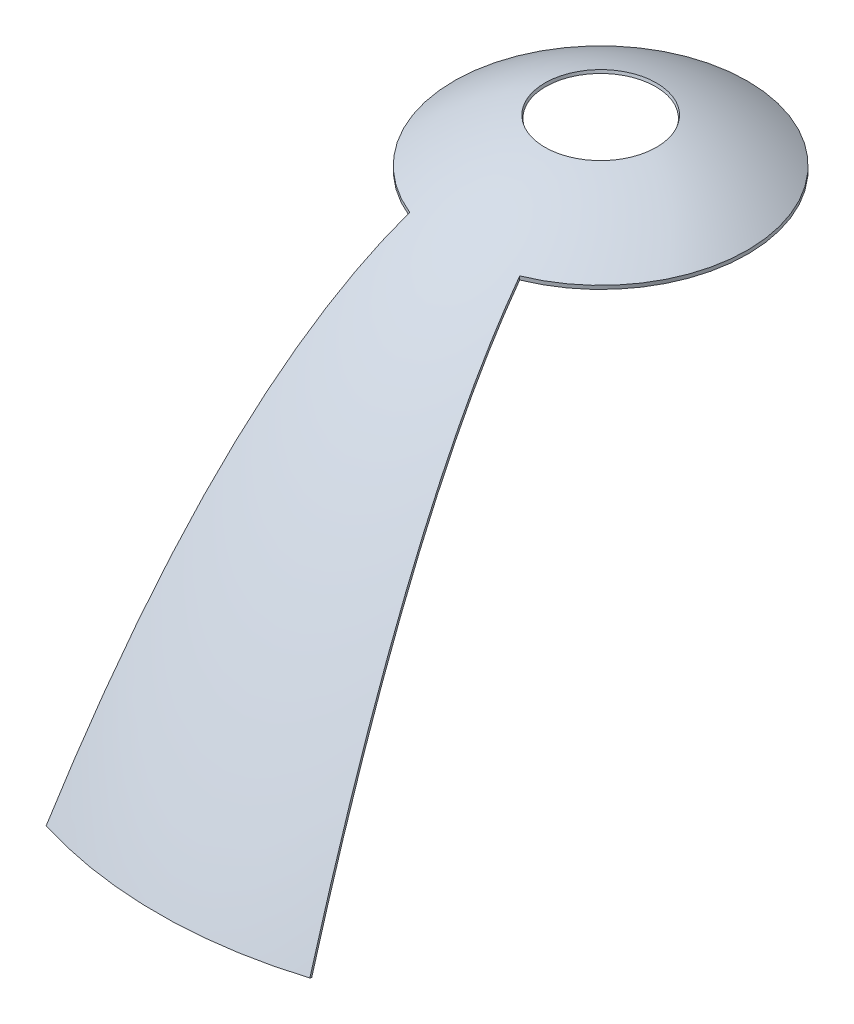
ISO-10303-21;
HEADER;
FILE_DESCRIPTION(('STEP AP214'),'2;1');
FILE_NAME('part.step','',(''),(''),'','','');
FILE_SCHEMA(('AUTOMOTIVE_DESIGN { 1 0 10303 214 1 1 1 1 }'));
ENDSEC;
DATA;
#1=APPLICATION_CONTEXT('core data for automotive mechanical design processes');
#2=APPLICATION_PROTOCOL_DEFINITION('international standard','automotive_design',2000,#1);
#3=PRODUCT_CONTEXT('',#1,'mechanical');
#4=PRODUCT('Part','Part','',(#3));
#5=PRODUCT_RELATED_PRODUCT_CATEGORY('part','',(#4));
#6=PRODUCT_DEFINITION_FORMATION('','',#4);
#7=PRODUCT_DEFINITION_CONTEXT('part definition',#1,'design');
#8=PRODUCT_DEFINITION('design','',#6,#7);
#9=PRODUCT_DEFINITION_SHAPE('','',#8);
#10=(LENGTH_UNIT() NAMED_UNIT(*) SI_UNIT(.MILLI.,.METRE.));
#11=(NAMED_UNIT(*) PLANE_ANGLE_UNIT() SI_UNIT($,.RADIAN.));
#12=(NAMED_UNIT(*) SI_UNIT($,.STERADIAN.) SOLID_ANGLE_UNIT());
#13=UNCERTAINTY_MEASURE_WITH_UNIT(LENGTH_MEASURE(1.E-05),#10,'distance_accuracy_value','');
#14=(GEOMETRIC_REPRESENTATION_CONTEXT(3) GLOBAL_UNCERTAINTY_ASSIGNED_CONTEXT((#13)) GLOBAL_UNIT_ASSIGNED_CONTEXT((#10,
#11,#12)) REPRESENTATION_CONTEXT('',''));
#15=CARTESIAN_POINT('',(0.,0.,0.));
#16=DIRECTION('',(0.,0.,1.));
#17=DIRECTION('',(1.,0.,0.));
#18=AXIS2_PLACEMENT_3D('',#15,#16,#17);
#19=CARTESIAN_POINT('',(-7.60368371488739,64.2465592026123,0.));
#20=CARTESIAN_POINT('',(-8.75613907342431,63.9372608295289,0.));
#21=CARTESIAN_POINT('',(-11.0024123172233,63.2031834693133,0.));
#22=CARTESIAN_POINT('',(-15.5311840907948,61.2016276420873,0.));
#23=CARTESIAN_POINT('',(-21.1339600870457,57.7361302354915,0.));
#24=CARTESIAN_POINT('',(-27.8053729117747,52.0322327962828,0.));
#25=CARTESIAN_POINT('',(-34.4185115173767,44.7890583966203,0.));
#26=CARTESIAN_POINT('',(-40.9799131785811,36.0065554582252,0.));
#27=CARTESIAN_POINT('',(-46.4060814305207,27.4053913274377,0.));
#28=CARTESIAN_POINT('',(-50.7234198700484,19.7538499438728,0.));
#29=CARTESIAN_POINT('',(-53.9487924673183,13.6319795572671,0.));
#30=CARTESIAN_POINT('',(-56.6295110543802,8.20367023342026,0.));
#31=CARTESIAN_POINT('',(-58.762424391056,3.6814756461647,0.));
#32=CARTESIAN_POINT('',(-59.8376879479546,1.33240552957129,0.));
#33=CARTESIAN_POINT('',(-60.3646091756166,0.164499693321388,0.));
#34=B_SPLINE_CURVE_WITH_KNOTS('',3,(#19,#20,#21,#22,#23,#24,#25,#26,#27,#28,#29,#30,#31,#32,
#33),.UNSPECIFIED.,.F.,.F.,(4,1,1,1,1,1,1,1,1,1,1,1,4),(0.496025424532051,0.496245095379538,
0.496464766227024,0.496904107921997,0.49734344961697,0.497782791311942,0.498222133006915,
0.498661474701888,0.498881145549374,0.499100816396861,0.499320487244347,0.49943032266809,
0.499540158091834),.UNSPECIFIED.);
#35=CARTESIAN_POINT('',(0.,0.,0.));
#36=DIRECTION('',(0.,-1.,0.));
#37=AXIS1_PLACEMENT('',#35,#36);
#38=SURFACE_OF_REVOLUTION('',#34,#37);
#39=CARTESIAN_POINT('',(0.,58.2847956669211,0.));
#40=DIRECTION('',(0.,-1.,0.));
#41=DIRECTION('',(0.,0.,-1.));
#42=AXIS2_PLACEMENT_3D('',#39,#40,#41);
#43=CIRCLE('',#42,20.0000000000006);
#44=CARTESIAN_POINT('',(7.5,58.2847956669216,18.5404962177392));
#45=VERTEX_POINT('',#44);
#46=CARTESIAN_POINT('',(-7.5,58.2847956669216,18.5404962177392));
#47=VERTEX_POINT('',#46);
#48=EDGE_CURVE('E79',#45,#47,#43,.F.);
#49=ORIENTED_EDGE('',*,*,#48,.T.);
#50=CARTESIAN_POINT('',(-7.49999999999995,58.2847956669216,18.540496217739));
#51=CARTESIAN_POINT('',(-7.63904423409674,57.9133384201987,19.0594163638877));
#52=CARTESIAN_POINT('',(-7.77623549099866,57.5316467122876,19.5714211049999));
#53=CARTESIAN_POINT('',(-8.04665504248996,56.7506706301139,20.5806406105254));
#54=CARTESIAN_POINT('',(-8.17989292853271,56.3514358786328,21.07789117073));
#55=CARTESIAN_POINT('',(-8.44267026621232,55.5369276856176,22.058589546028));
#56=CARTESIAN_POINT('',(-8.57221550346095,55.1216820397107,22.5420589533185));
#57=CARTESIAN_POINT('',(-8.82784207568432,54.2764890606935,23.4960703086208));
#58=CARTESIAN_POINT('',(-8.95392648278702,53.8465555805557,23.9666237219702));
#59=CARTESIAN_POINT('',(-9.20283586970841,52.9732084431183,24.8955662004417));
#60=CARTESIAN_POINT('',(-9.32566207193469,52.5297999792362,25.3539598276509));
#61=CARTESIAN_POINT('',(-9.56823531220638,51.6306090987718,26.2592554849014));
#62=CARTESIAN_POINT('',(-9.68798238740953,51.1748268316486,26.7061576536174));
#63=CARTESIAN_POINT('',(-9.9231557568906,50.2573886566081,27.5838366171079));
#64=CARTESIAN_POINT('',(-10.0386161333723,49.7958630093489,28.0147406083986));
#65=CARTESIAN_POINT('',(-10.2668369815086,48.8626132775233,28.8664724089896));
#66=CARTESIAN_POINT('',(-10.379596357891,48.390885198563,29.2872961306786));
#67=CARTESIAN_POINT('',(-10.6025389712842,47.438088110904,30.1193292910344));
#68=CARTESIAN_POINT('',(-10.7127211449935,46.9570153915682,30.5305347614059));
#69=CARTESIAN_POINT('',(-10.9306190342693,45.9863399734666,31.3437407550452));
#70=CARTESIAN_POINT('',(-11.038333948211,45.4967345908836,31.7457382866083));
#71=CARTESIAN_POINT('',(-11.2513956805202,44.5097641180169,32.5408954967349));
#72=CARTESIAN_POINT('',(-11.3567421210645,44.0123978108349,32.9340537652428));
#73=CARTESIAN_POINT('',(-11.5651515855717,43.0106416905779,33.7118484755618));
#74=CARTESIAN_POINT('',(-11.6682147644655,42.5062523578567,34.0964854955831));
#75=CARTESIAN_POINT('',(-11.9805351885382,40.9515652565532,35.2620811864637));
#76=CARTESIAN_POINT('',(-12.1862700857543,39.8906707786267,36.0298942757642));
#77=CARTESIAN_POINT('',(-12.5893169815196,37.7456834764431,37.5340857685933));
#78=CARTESIAN_POINT('',(-12.786630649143,36.6615953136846,38.2704704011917));
#79=CARTESIAN_POINT('',(-13.173686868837,34.4730379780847,39.7149838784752));
#80=CARTESIAN_POINT('',(-13.3634274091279,33.3685635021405,40.4231052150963));
#81=CARTESIAN_POINT('',(-13.7360319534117,31.1417305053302,41.8136843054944));
#82=CARTESIAN_POINT('',(-13.9188926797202,30.0193638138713,42.4961298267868));
#83=CARTESIAN_POINT('',(-14.2783201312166,27.758947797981,43.8375313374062));
#84=CARTESIAN_POINT('',(-14.4548837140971,26.6208910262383,44.496475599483));
#85=CARTESIAN_POINT('',(-14.8022085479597,24.3310770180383,45.7927095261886));
#86=CARTESIAN_POINT('',(-14.9729675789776,23.1793147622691,46.4299909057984));
#87=CARTESIAN_POINT('',(-15.3133685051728,20.8345346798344,47.7003844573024));
#88=CARTESIAN_POINT('',(-15.4828706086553,19.6412142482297,48.3329749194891));
#89=CARTESIAN_POINT('',(-15.8166017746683,17.2438405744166,49.5784765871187));
#90=CARTESIAN_POINT('',(-15.9808315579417,16.0397888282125,50.1913904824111));
#91=CARTESIAN_POINT('',(-16.3043275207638,13.6227009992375,51.3986938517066));
#92=CARTESIAN_POINT('',(-16.4635966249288,12.4096707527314,51.9930942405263));
#93=CARTESIAN_POINT('',(-16.7774639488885,9.97633727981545,53.1644630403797));
#94=CARTESIAN_POINT('',(-16.9320672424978,8.7560438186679,53.7414503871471));
#95=CARTESIAN_POINT('',(-17.160712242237,6.92084476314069,54.5947651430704));
#96=CARTESIAN_POINT('',(-17.2363206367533,6.30884410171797,54.8769395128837));
#97=CARTESIAN_POINT('',(-17.3865223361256,5.08298410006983,55.4374998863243));
#98=CARTESIAN_POINT('',(-17.4611156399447,4.46912475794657,55.7158858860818));
#99=CARTESIAN_POINT('',(-17.6091539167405,3.2410868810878,56.2683722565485));
#100=CARTESIAN_POINT('',(-17.6826011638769,2.62691243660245,56.5424811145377));
#101=CARTESIAN_POINT('',(-17.8285647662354,1.39691714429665,57.0872246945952));
#102=CARTESIAN_POINT('',(-17.901081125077,0.781096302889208,57.357859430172));
#103=CARTESIAN_POINT('',(-17.9731522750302,0.164499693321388,57.6268326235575));
#104=B_SPLINE_CURVE_WITH_KNOTS('',3,(#50,#51,#52,#53,#54,#55,#56,#57,#58,#59,#60,#61,#62,#63,
#64,#65,#66,#67,#68,#69,#70,#71,#72,#73,#74,#75,#76,#77,#78,#79,#80,#81,#82,#83,#84,#85,#86,#87,
#88,#89,#90,#91,#92,#93,#94,#95,#96,#97,#98,#99,#100,#101,#102,#103),.UNSPECIFIED.,.F.,.F.,(4,2,
2,2,2,2,2,2,2,2,2,2,2,2,2,2,2,2,2,2,2,2,2,2,2,2,4),(0.,1.95920133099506,3.91317864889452,
5.86390434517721,7.81283840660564,9.76103062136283,11.7091993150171,13.6346750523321,
15.560918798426,17.4879437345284,19.4155861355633,21.3435338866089,23.2713504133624,
27.2475553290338,31.2229684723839,35.1994307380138,39.1777640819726,43.1580556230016,
47.1398526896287,51.2232944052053,55.3061755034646,59.3866020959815,63.4624186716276,
65.4968496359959,67.5312826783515,69.5609665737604,71.590642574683),.UNSPECIFIED.);
#105=CARTESIAN_POINT('',(-17.9731522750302,0.164499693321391,57.6268326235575));
#106=VERTEX_POINT('',#105);
#107=EDGE_CURVE('E89',#47,#106,#104,.T.);
#108=ORIENTED_EDGE('',*,*,#107,.T.);
#109=CARTESIAN_POINT('',(0.,0.164499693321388,0.));
#110=DIRECTION('',(0.,-1.,0.));
#111=DIRECTION('',(0.,0.,-1.));
#112=AXIS2_PLACEMENT_3D('',#109,#110,#111);
#113=CIRCLE('',#112,60.3646091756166);
#114=CARTESIAN_POINT('',(17.9731522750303,0.16449969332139,57.6268326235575));
#115=VERTEX_POINT('',#114);
#116=EDGE_CURVE('E98',#115,#106,#113,.T.);
#117=ORIENTED_EDGE('',*,*,#116,.F.);
#118=CARTESIAN_POINT('',(17.9731522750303,0.164499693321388,57.6268326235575));
#119=CARTESIAN_POINT('',(17.9222354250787,0.600151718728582,57.4368083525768));
#120=CARTESIAN_POINT('',(17.8710927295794,1.03540914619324,57.2459412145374));
#121=CARTESIAN_POINT('',(17.7683462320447,1.90511163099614,56.8624860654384));
#122=CARTESIAN_POINT('',(17.7167424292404,2.33955668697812,56.6698980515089));
#123=CARTESIAN_POINT('',(17.5611652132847,3.64214105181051,56.0892759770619));
#124=CARTESIAN_POINT('',(17.4564851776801,4.50902291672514,55.6986047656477));
#125=CARTESIAN_POINT('',(17.245068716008,6.23948860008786,54.9095877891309));
#126=CARTESIAN_POINT('',(17.1383314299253,7.10307085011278,54.5112388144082));
#127=CARTESIAN_POINT('',(16.9227406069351,8.82658811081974,53.7066429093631));
#128=CARTESIAN_POINT('',(16.8138864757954,9.68652201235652,53.3003937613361));
#129=CARTESIAN_POINT('',(16.5939637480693,11.4023213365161,52.4796309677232));
#130=CARTESIAN_POINT('',(16.4828948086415,12.2581861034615,52.0651160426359));
#131=CARTESIAN_POINT('',(16.2584303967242,13.9653995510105,51.2274034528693));
#132=CARTESIAN_POINT('',(16.1450348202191,14.8167480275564,50.8042053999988));
#133=CARTESIAN_POINT('',(15.912785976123,16.5367732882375,49.9374409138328));
#134=CARTESIAN_POINT('',(15.7938675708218,17.405318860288,49.4936313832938));
#135=CARTESIAN_POINT('',(15.5533156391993,19.1366727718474,48.5958793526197));
#136=CARTESIAN_POINT('',(15.4316823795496,19.9994816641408,48.1419378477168));
#137=CARTESIAN_POINT('',(15.1855465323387,21.7188213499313,47.223346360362));
#138=CARTESIAN_POINT('',(15.0610443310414,22.5753529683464,46.7586978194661));
#139=CARTESIAN_POINT('',(14.8089943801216,24.2815485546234,45.8180345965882));
#140=CARTESIAN_POINT('',(14.6814470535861,25.1312134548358,45.3420214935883));
#141=CARTESIAN_POINT('',(14.423109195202,26.823039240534,44.3778914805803));
#142=CARTESIAN_POINT('',(14.2923189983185,27.6652008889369,43.889775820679));
#143=CARTESIAN_POINT('',(14.0272736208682,29.3413295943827,42.9006130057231));
#144=CARTESIAN_POINT('',(13.8930185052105,30.1752968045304,42.3995660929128));
#145=CARTESIAN_POINT('',(13.6135584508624,31.8783665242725,41.3566069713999));
#146=CARTESIAN_POINT('',(13.4681511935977,32.7469740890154,40.8139396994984));
#147=CARTESIAN_POINT('',(13.1729278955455,34.4730129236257,39.7121513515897));
#148=CARTESIAN_POINT('',(13.0231116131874,35.3304435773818,39.1530293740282));
#149=CARTESIAN_POINT('',(12.7187320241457,37.0328037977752,38.0170692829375));
#150=CARTESIAN_POINT('',(12.5641681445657,37.8777318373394,37.4402290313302));
#151=CARTESIAN_POINT('',(12.2499014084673,39.5536153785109,36.2673696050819));
#152=CARTESIAN_POINT('',(12.0901969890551,40.3845665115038,35.6713445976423));
#153=CARTESIAN_POINT('',(11.7651916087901,42.0308486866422,34.4584080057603));
#154=CARTESIAN_POINT('',(11.5998870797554,42.8461692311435,33.8414831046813));
#155=CARTESIAN_POINT('',(11.2651727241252,44.4496057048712,32.5923121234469));
#156=CARTESIAN_POINT('',(11.0958269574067,45.2379208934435,31.9603051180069));
#157=CARTESIAN_POINT('',(10.7508513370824,46.793945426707,30.6728385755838));
#158=CARTESIAN_POINT('',(10.5752207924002,47.561652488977,30.0173764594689));
#159=CARTESIAN_POINT('',(10.2172963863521,49.072790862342,28.6815843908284));
#160=CARTESIAN_POINT('',(10.0350063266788,49.8162355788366,28.0012686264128));
#161=CARTESIAN_POINT('',(9.66331254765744,51.2748803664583,26.6140885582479));
#162=CARTESIAN_POINT('',(9.47391508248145,51.9901041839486,25.9072475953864));
#163=CARTESIAN_POINT('',(9.08744467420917,53.3880870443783,24.4649203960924));
#164=CARTESIAN_POINT('',(8.89037690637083,54.0708673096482,23.7294534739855));
#165=CARTESIAN_POINT('',(8.62577906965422,54.9441805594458,22.7419609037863));
#166=CARTESIAN_POINT('',(8.56195869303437,55.1516077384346,22.5037800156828));
#167=CARTESIAN_POINT('',(8.43348128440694,55.56255302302,22.0242957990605));
#168=CARTESIAN_POINT('',(8.36882427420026,55.7660712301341,21.7829925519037));
#169=CARTESIAN_POINT('',(8.23866137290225,56.1689956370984,21.2972179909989));
#170=CARTESIAN_POINT('',(8.1731555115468,56.3684019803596,21.0527467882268));
#171=CARTESIAN_POINT('',(8.0410769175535,56.7635052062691,20.5598227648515));
#172=CARTESIAN_POINT('',(7.97450153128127,56.9591888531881,20.3113600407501));
#173=CARTESIAN_POINT('',(7.8404655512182,57.3460029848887,19.8111309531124));
#174=CARTESIAN_POINT('',(7.77300491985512,57.5371332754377,19.5593644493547));
#175=CARTESIAN_POINT('',(7.63718058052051,57.9146157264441,19.0524611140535));
#176=CARTESIAN_POINT('',(7.56881675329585,58.1009672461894,18.7973238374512));
#177=CARTESIAN_POINT('',(7.49999999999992,58.2847956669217,18.5404962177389));
#178=B_SPLINE_CURVE_WITH_KNOTS('',3,(#118,#119,#120,#121,#122,#123,#124,#125,#126,#127,#128,
#129,#130,#131,#132,#133,#134,#135,#136,#137,#138,#139,#140,#141,#142,#143,#144,#145,#146,#147,
#148,#149,#150,#151,#152,#153,#154,#155,#156,#157,#158,#159,#160,#161,#162,#163,#164,#165,#166,
#167,#168,#169,#170,#171,#172,#173,#174,#175,#176,#177),.UNSPECIFIED.,.F.,.F.,(4,2,2,2,2,2,2,2,
2,2,2,2,2,2,2,2,2,2,2,2,2,2,2,2,2,2,2,2,2,4),(0.,1.43403067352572,2.86806373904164,
5.73779738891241,8.60875790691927,11.4805363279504,14.3527627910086,17.2251179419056,
20.1728144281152,23.12022263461,26.067236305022,29.0138428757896,31.9601463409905,
34.9063946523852,38.0095928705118,41.1129614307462,44.2167059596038,47.3214032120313,
50.4281173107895,53.5011004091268,56.5744224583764,59.6460166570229,62.7149686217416,
65.7818846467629,66.7485334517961,67.7151571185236,68.6817470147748,69.6512981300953,
70.6208905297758,71.5906122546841),.UNSPECIFIED.);
#179=EDGE_CURVE('E92',#115,#45,#178,.T.);
#180=ORIENTED_EDGE('',*,*,#179,.T.);
#181=EDGE_LOOP('',(#49,#108,#117,#180));
#182=FACE_BOUND('',#181,.T.);
#183=CARTESIAN_POINT('',(0.,64.2465592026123,0.));
#184=DIRECTION('',(0.,-1.,0.));
#185=DIRECTION('',(0.,0.,-1.));
#186=AXIS2_PLACEMENT_3D('',#183,#184,#185);
#187=CIRCLE('',#186,7.60368371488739);
#188=CARTESIAN_POINT('',(0.,64.2465592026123,-7.60368371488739));
#189=VERTEX_POINT('',#188);
#190=EDGE_CURVE('E88',#189,#189,#187,.T.);
#191=ORIENTED_EDGE('',*,*,#190,.T.);
#192=EDGE_LOOP('',(#191));
#193=FACE_BOUND('',#192,.T.);
#194=ADVANCED_FACE('F32',(#182,#193),#38,.T.);
#195=CARTESIAN_POINT('',(0.,0.164499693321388,0.));
#196=DIRECTION('',(0.,1.,0.));
#197=DIRECTION('',(0.,0.,1.));
#198=AXIS2_PLACEMENT_3D('',#195,#196,#197);
#199=CONICAL_SURFACE('',#198,60.3646091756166,1.14697219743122);
#200=ORIENTED_EDGE('',*,*,#116,.T.);
#201=CARTESIAN_POINT('',(-26.2214343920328,14.5349801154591,88.4098405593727));
#202=CARTESIAN_POINT('',(-25.4245611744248,13.1463818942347,85.435869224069));
#203=CARTESIAN_POINT('',(-24.6276838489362,11.7578188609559,82.4618825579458));
#204=CARTESIAN_POINT('',(-23.033916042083,8.98080587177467,76.5138601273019));
#205=CARTESIAN_POINT('',(-22.2370255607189,7.59235591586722,73.5398243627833));
#206=CARTESIAN_POINT('',(-20.6432265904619,4.81561193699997,67.5916856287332));
#207=CARTESIAN_POINT('',(-19.8463181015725,3.42731791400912,64.6175826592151));
#208=CARTESIAN_POINT('',(-18.2524738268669,0.650963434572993,58.6692748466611));
#209=CARTESIAN_POINT('',(-17.4555380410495,-0.737097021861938,55.6950700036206));
#210=CARTESIAN_POINT('',(-15.8616236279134,-3.51285366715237,49.7465004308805));
#211=CARTESIAN_POINT('',(-15.0646450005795,-4.90054985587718,46.7721357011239));
#212=CARTESIAN_POINT('',(-13.8691213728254,-6.98161610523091,42.3103807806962));
#213=CARTESIAN_POINT('',(-13.4706042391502,-7.6752251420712,40.8230945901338));
#214=CARTESIAN_POINT('',(-12.6735440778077,-9.06222121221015,37.8484255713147));
#215=CARTESIAN_POINT('',(-12.2750010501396,-9.75560824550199,36.361042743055));
#216=CARTESIAN_POINT('',(-11.4778782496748,-11.1420686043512,33.3861399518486));
#217=CARTESIAN_POINT('',(-11.0792984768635,-11.8351419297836,31.8986199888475));
#218=CARTESIAN_POINT('',(-10.2820844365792,-13.220820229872,28.9233766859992));
#219=CARTESIAN_POINT('',(-9.8834501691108,-13.9134252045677,27.4356533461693));
#220=CARTESIAN_POINT('',(-9.08609601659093,-15.2979009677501,24.4598871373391));
#221=CARTESIAN_POINT('',(-8.68737613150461,-15.9897717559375,22.9718442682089));
#222=CARTESIAN_POINT('',(-8.08918546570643,-17.0266240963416,20.7393663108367));
#223=CARTESIAN_POINT('',(-7.88977007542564,-17.3720826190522,19.9951379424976));
#224=CARTESIAN_POINT('',(-7.49088650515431,-18.0625446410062,18.5064841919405));
#225=CARTESIAN_POINT('',(-7.2914183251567,-18.4075481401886,17.7620588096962));
#226=CARTESIAN_POINT('',(-7.09191584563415,-18.7522555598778,17.017505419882));
#227=B_SPLINE_CURVE_WITH_KNOTS('',3,(#201,#202,#203,#204,#205,#206,#207,#208,#209,#210,#211,
#212,#213,#214,#215,#216,#217,#218,#219,#220,#221,#222,#223,#224,#225,#226),.UNSPECIFIED.,.F.,
.F.,(4,2,2,2,2,2,2,2,2,2,2,2,4),(0.,10.1325937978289,20.2651871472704,30.3977784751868,
40.5303702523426,50.6629656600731,55.7292627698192,60.7955600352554,65.8618593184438,
70.9281581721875,75.9944590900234,78.527610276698,81.060761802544),.UNSPECIFIED.);
#228=CARTESIAN_POINT('',(-17.8787064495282,-2.66453525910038E-12,57.2743560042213));
#229=VERTEX_POINT('',#228);
#230=EDGE_CURVE('E99',#106,#229,#227,.T.);
#231=ORIENTED_EDGE('',*,*,#230,.T.);
#232=CARTESIAN_POINT('',(0.,0.,0.));
#233=DIRECTION('',(0.,-1.,0.));
#234=DIRECTION('',(0.,0.,-1.));
#235=AXIS2_PLACEMENT_3D('',#232,#233,#234);
#236=CIRCLE('',#235,60.);
#237=CARTESIAN_POINT('',(17.8787064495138,0.,57.2743560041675));
#238=VERTEX_POINT('',#237);
#239=EDGE_CURVE('E152',#238,#229,#236,.T.);
#240=ORIENTED_EDGE('',*,*,#239,.F.);
#241=CARTESIAN_POINT('',(7.09191584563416,-18.7522555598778,17.017505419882));
#242=CARTESIAN_POINT('',(7.28181302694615,-18.4241460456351,17.7262113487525));
#243=CARTESIAN_POINT('',(7.47167894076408,-18.0957666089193,18.4348005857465));
#244=CARTESIAN_POINT('',(7.85136221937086,-17.4385892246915,19.8517978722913));
#245=CARTESIAN_POINT('',(8.04117958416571,-17.1097912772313,20.5602059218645));
#246=CARTESIAN_POINT('',(8.61057979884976,-16.1229517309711,22.6852364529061));
#247=CARTESIAN_POINT('',(8.99011087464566,-15.4644642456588,24.1016657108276));
#248=CARTESIAN_POINT('',(9.74909143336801,-14.1467895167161,26.9342197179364));
#249=CARTESIAN_POINT('',(10.128540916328,-13.4876022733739,28.3503444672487));
#250=CARTESIAN_POINT('',(10.8873872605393,-12.1687754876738,31.1823975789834));
#251=CARTESIAN_POINT('',(11.2667841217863,-11.5091359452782,32.5983259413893));
#252=CARTESIAN_POINT('',(12.0639217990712,-10.122803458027,35.5732842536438));
#253=CARTESIAN_POINT('',(12.4816588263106,-9.39607799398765,37.1323000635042));
#254=CARTESIAN_POINT('',(13.3171030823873,-7.94237156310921,40.2502204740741));
#255=CARTESIAN_POINT('',(13.7348103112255,-7.21539059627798,41.809125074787));
#256=CARTESIAN_POINT('',(14.9879007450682,-5.03417776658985,46.4857222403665));
#257=CARTESIAN_POINT('',(15.8232525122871,-3.5796762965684,49.6032974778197));
#258=CARTESIAN_POINT('',(17.455538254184,-0.737096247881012,55.6950707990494));
#259=CARTESIAN_POINT('',(18.2524743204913,0.650964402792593,58.6692766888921));
#260=CARTESIAN_POINT('',(19.8463191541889,3.42731963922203,64.6175865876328));
#261=CARTESIAN_POINT('',(20.6432279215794,4.81561422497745,67.5916905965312));
#262=CARTESIAN_POINT('',(22.2370269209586,7.5923583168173,73.5398294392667));
#263=CARTESIAN_POINT('',(23.0339171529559,8.98080782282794,76.5138642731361));
#264=CARTESIAN_POINT('',(24.6276844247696,11.7578198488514,82.4618847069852));
#265=CARTESIAN_POINT('',(25.424561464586,13.1463823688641,85.435870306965));
#266=CARTESIAN_POINT('',(26.2214343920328,14.5349801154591,88.4098405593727));
#267=B_SPLINE_CURVE_WITH_KNOTS('',3,(#241,#242,#243,#244,#245,#246,#247,#248,#249,#250,#251,
#252,#253,#254,#255,#256,#257,#258,#259,#260,#261,#262,#263,#264,#265,#266),.UNSPECIFIED.,.F.,
.F.,(4,2,2,2,2,2,2,2,2,2,2,2,4),(0.,2.41118789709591,4.82237549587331,9.64474935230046,
14.4671212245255,19.2894934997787,24.5997175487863,29.9099414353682,40.5303915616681,
50.662986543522,60.7955815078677,70.9281716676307,81.0607618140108),.UNSPECIFIED.);
#268=EDGE_CURVE('E53',#238,#115,#267,.T.);
#269=ORIENTED_EDGE('',*,*,#268,.T.);
#270=EDGE_LOOP('',(#200,#231,#240,#269));
#271=FACE_BOUND('',#270,.T.);
#272=ADVANCED_FACE('F134',(#271),#199,.T.);
#273=CARTESIAN_POINT('',(20684.4293230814,-999750.970992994,0.));
#274=CARTESIAN_POINT('',(-28405.7592277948,999661.394521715,0.));
#275=CARTESIAN_POINT('',(36125.3946410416,-999312.188136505,0.));
#276=B_SPLINE_CURVE_WITH_KNOTS('',2,(#273,#274,#275),.UNSPECIFIED.,.F.,.F.,(3,3),(0.,1.),.UNSPECIFIED.);
#277=CARTESIAN_POINT('',(0.,0.,0.));
#278=DIRECTION('',(0.,-1.,0.));
#279=AXIS1_PLACEMENT('',#277,#278);
#280=SURFACE_OF_REVOLUTION('',#276,#279);
#281=CARTESIAN_POINT('',(0.,63.8602307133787,0.));
#282=DIRECTION('',(0.,-1.,0.));
#283=DIRECTION('',(0.,0.,-1.));
#284=AXIS2_PLACEMENT_3D('',#281,#282,#283);
#285=CIRCLE('',#284,7.50000006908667);
#286=CARTESIAN_POINT('',(0.,63.8602307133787,-7.50000006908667));
#287=VERTEX_POINT('',#286);
#288=EDGE_CURVE('E150',#287,#287,#285,.T.);
#289=ORIENTED_EDGE('',*,*,#288,.F.);
#290=EDGE_LOOP('',(#289));
#291=FACE_BOUND('',#290,.T.);
#292=ORIENTED_EDGE('',*,*,#239,.T.);
#293=CARTESIAN_POINT('',(-17.8787064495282,-2.66453525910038E-12,57.2743560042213));
#294=CARTESIAN_POINT('',(-17.7443341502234,1.1497346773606,56.7728717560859));
#295=CARTESIAN_POINT('',(-17.6083906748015,2.29674163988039,56.2655237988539));
#296=CARTESIAN_POINT('',(-17.3329376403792,4.58643864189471,55.2375190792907));
#297=CARTESIAN_POINT('',(-17.1934230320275,5.7291196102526,54.716843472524));
#298=CARTESIAN_POINT('',(-16.9106531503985,8.00908101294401,53.6615319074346));
#299=CARTESIAN_POINT('',(-16.7673939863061,9.14635425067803,53.1268814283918));
#300=CARTESIAN_POINT('',(-16.4769309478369,11.414351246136,52.0428586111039));
#301=CARTESIAN_POINT('',(-16.3297243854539,12.5450698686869,51.4934762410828));
#302=CARTESIAN_POINT('',(-16.0311357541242,14.7987600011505,50.3791282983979));
#303=CARTESIAN_POINT('',(-15.8797522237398,15.9217286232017,49.8141572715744));
#304=CARTESIAN_POINT('',(-15.5725448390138,18.1586563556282,48.6676437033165));
#305=CARTESIAN_POINT('',(-15.4167207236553,19.272614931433,48.0861001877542));
#306=CARTESIAN_POINT('',(-15.1037075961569,21.4664893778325,46.917919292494));
#307=CARTESIAN_POINT('',(-14.9466202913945,22.546621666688,46.3316614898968));
#308=CARTESIAN_POINT('',(-14.6275566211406,24.6957220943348,45.1408996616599));
#309=CARTESIAN_POINT('',(-14.4655814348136,25.7646928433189,44.536400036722));
#310=CARTESIAN_POINT('',(-14.1363531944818,27.890034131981,43.3077035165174));
#311=CARTESIAN_POINT('',(-13.9691016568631,28.9464081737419,42.6835122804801));
#312=CARTESIAN_POINT('',(-13.6288677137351,31.0449686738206,41.4137419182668));
#313=CARTESIAN_POINT('',(-13.4558866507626,32.0871583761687,40.7681678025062));
#314=CARTESIAN_POINT('',(-13.1036626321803,34.1555654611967,39.4536498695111));
#315=CARTESIAN_POINT('',(-12.9244199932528,35.1817836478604,38.7847072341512));
#316=CARTESIAN_POINT('',(-12.5590389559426,37.2162549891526,37.421086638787));
#317=CARTESIAN_POINT('',(-12.3728984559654,38.2245025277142,36.7264008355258));
#318=CARTESIAN_POINT('',(-12.0727790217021,39.8013394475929,35.6063398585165));
#319=CARTESIAN_POINT('',(-11.9612761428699,40.3769783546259,35.1902054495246));
#320=CARTESIAN_POINT('',(-11.7356034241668,41.520468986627,34.3479833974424));
#321=CARTESIAN_POINT('',(-11.6214334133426,42.0883202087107,33.9218951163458));
#322=CARTESIAN_POINT('',(-11.3903126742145,43.2153292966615,33.0593407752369));
#323=CARTESIAN_POINT('',(-11.2733625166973,43.7744889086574,32.6228768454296));
#324=CARTESIAN_POINT('',(-11.0365512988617,44.8831654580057,31.7390853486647));
#325=CARTESIAN_POINT('',(-10.9166914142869,45.4326861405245,31.2917621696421));
#326=CARTESIAN_POINT('',(-10.6739137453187,46.5210797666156,30.3857035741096));
#327=CARTESIAN_POINT('',(-10.5509975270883,47.0599579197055,29.9269740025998));
#328=CARTESIAN_POINT('',(-10.3019398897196,48.1259970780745,28.9974782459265));
#329=CARTESIAN_POINT('',(-10.1758001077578,48.6531637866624,28.5267181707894));
#330=CARTESIAN_POINT('',(-9.91848385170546,49.7012344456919,27.5664008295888));
#331=CARTESIAN_POINT('',(-9.78726449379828,50.2219814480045,27.0766835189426));
#332=CARTESIAN_POINT('',(-9.52108602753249,51.2490305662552,26.083291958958));
#333=CARTESIAN_POINT('',(-9.38612690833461,51.7553326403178,25.5796176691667));
#334=CARTESIAN_POINT('',(-9.11221487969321,52.7520497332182,24.5573640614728));
#335=CARTESIAN_POINT('',(-8.97326022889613,53.2424576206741,24.0387782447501));
#336=CARTESIAN_POINT('',(-8.69106759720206,54.2057813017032,22.9856210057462));
#337=CARTESIAN_POINT('',(-8.54782506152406,54.6786772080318,22.4510325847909));
#338=CARTESIAN_POINT('',(-8.25672112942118,55.6052062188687,21.3646179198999));
#339=CARTESIAN_POINT('',(-8.10885089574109,56.0587980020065,20.8127586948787));
#340=CARTESIAN_POINT('',(-7.80811167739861,56.9446385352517,19.690384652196));
#341=CARTESIAN_POINT('',(-7.65522765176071,57.3768109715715,19.1198137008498));
#342=CARTESIAN_POINT('',(-7.50000000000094,57.7962204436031,18.5404962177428));
#343=B_SPLINE_CURVE_WITH_KNOTS('',3,(#293,#294,#295,#296,#297,#298,#299,#300,#301,#302,#303,
#304,#305,#306,#307,#308,#309,#310,#311,#312,#313,#314,#315,#316,#317,#318,#319,#320,#321,#322,
#323,#324,#325,#326,#327,#328,#329,#330,#331,#332,#333,#334,#335,#336,#337,#338,#339,#340,#341,
#342),.UNSPECIFIED.,.F.,.F.,(4,2,2,2,2,2,2,2,2,2,2,2,2,2,2,2,2,2,2,2,2,2,2,2,4),(0.,
3.78456005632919,7.57480426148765,11.369156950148,15.1661625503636,18.9645139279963,
22.7630890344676,26.4798383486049,30.1956980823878,33.9104994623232,37.6244364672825,
41.3381859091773,45.0530762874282,47.2099779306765,49.3670182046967,51.5236193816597,
53.6793631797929,55.8340241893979,57.9876118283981,60.1677066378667,62.3478077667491,
64.5288738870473,66.7123453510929,68.9002769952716,71.0955134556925),.UNSPECIFIED.);
#344=CARTESIAN_POINT('',(-7.5,57.7962204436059,18.5404962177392));
#345=VERTEX_POINT('',#344);
#346=EDGE_CURVE('E12',#229,#345,#343,.T.);
#347=ORIENTED_EDGE('',*,*,#346,.T.);
#348=CARTESIAN_POINT('',(0.,57.7962204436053,0.));
#349=DIRECTION('',(0.,-1.,0.));
#350=DIRECTION('',(0.,0.,-1.));
#351=AXIS2_PLACEMENT_3D('',#348,#349,#350);
#352=CIRCLE('',#351,20.0000000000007);
#353=CARTESIAN_POINT('',(7.5,57.7962204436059,18.5404962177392));
#354=VERTEX_POINT('',#353);
#355=EDGE_CURVE('E46',#345,#354,#352,.T.);
#356=ORIENTED_EDGE('',*,*,#355,.T.);
#357=CARTESIAN_POINT('',(7.49999999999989,57.7962204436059,18.5404962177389));
#358=CARTESIAN_POINT('',(7.58220900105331,57.5741179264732,18.8473043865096));
#359=CARTESIAN_POINT('',(7.66376313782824,57.3484128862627,19.151668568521));
#360=CARTESIAN_POINT('',(7.82556435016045,56.8902561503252,19.7555189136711));
#361=CARTESIAN_POINT('',(7.90581171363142,56.657805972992,20.0550061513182));
#362=CARTESIAN_POINT('',(8.06503307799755,56.186534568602,20.649228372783));
#363=CARTESIAN_POINT('',(8.14400716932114,55.9477137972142,20.9439636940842));
#364=CARTESIAN_POINT('',(8.30043948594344,55.4649021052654,21.5277770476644));
#365=CARTESIAN_POINT('',(8.37790202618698,55.2209320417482,21.8168711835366));
#366=CARTESIAN_POINT('',(8.53162288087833,54.7273572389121,22.3905652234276));
#367=CARTESIAN_POINT('',(8.60788112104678,54.4777521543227,22.675164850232));
#368=CARTESIAN_POINT('',(8.7592179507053,53.9732400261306,23.2399615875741));
#369=CARTESIAN_POINT('',(8.83429648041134,53.7183327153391,23.5201584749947));
#370=CARTESIAN_POINT('',(9.08914844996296,52.8378324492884,24.4712789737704));
#371=CARTESIAN_POINT('',(9.26612654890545,52.2001010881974,25.1317702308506));
#372=CARTESIAN_POINT('',(9.61380034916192,50.899053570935,26.4293065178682));
#373=CARTESIAN_POINT('',(9.7844929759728,50.2357252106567,27.0663400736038));
#374=CARTESIAN_POINT('',(10.1200302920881,48.8865867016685,28.3185823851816));
#375=CARTESIAN_POINT('',(10.2848712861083,48.2007628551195,28.9337773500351));
#376=CARTESIAN_POINT('',(10.6090537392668,46.8095221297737,30.1436427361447));
#377=CARTESIAN_POINT('',(10.7683929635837,46.104097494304,30.7383048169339));
#378=CARTESIAN_POINT('',(11.0818650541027,44.6763254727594,31.9081985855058));
#379=CARTESIAN_POINT('',(11.2359983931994,43.9539796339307,32.483432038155));
#380=CARTESIAN_POINT('',(11.5408724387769,42.4873292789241,33.6212374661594));
#381=CARTESIAN_POINT('',(11.6915667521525,41.7428810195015,34.1836363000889));
#382=CARTESIAN_POINT('',(11.9882865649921,40.2407982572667,35.2910097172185));
#383=CARTESIAN_POINT('',(12.1343142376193,39.4831701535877,35.835992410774));
#384=CARTESIAN_POINT('',(12.4220507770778,37.9560364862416,36.9098397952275));
#385=CARTESIAN_POINT('',(12.5637605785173,37.1865335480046,37.4387079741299));
#386=CARTESIAN_POINT('',(12.8431636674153,35.6368287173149,38.481454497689));
#387=CARTESIAN_POINT('',(12.980857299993,34.8566277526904,38.9953341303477));
#388=CARTESIAN_POINT('',(13.2524908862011,33.2865986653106,40.0090844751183));
#389=CARTESIAN_POINT('',(13.3864310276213,32.4967710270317,40.5089558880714));
#390=CARTESIAN_POINT('',(13.6600046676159,30.8530973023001,41.5299466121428));
#391=CARTESIAN_POINT('',(13.7993851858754,29.9986230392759,42.0501217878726));
#392=CARTESIAN_POINT('',(14.074393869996,28.2806932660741,43.0764681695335));
#393=CARTESIAN_POINT('',(14.21002195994,27.4172375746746,43.5826390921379));
#394=CARTESIAN_POINT('',(14.4777770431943,25.6821296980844,44.5819146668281));
#395=CARTESIAN_POINT('',(14.6099036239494,24.8104765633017,45.0750177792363));
#396=CARTESIAN_POINT('',(14.8708768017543,23.0596936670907,46.048982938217));
#397=CARTESIAN_POINT('',(14.9997228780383,22.1805627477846,46.5298430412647));
#398=CARTESIAN_POINT('',(15.2543308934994,20.4154877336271,47.4800530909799));
#399=CARTESIAN_POINT('',(15.3800923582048,19.5295426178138,47.9494012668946));
#400=CARTESIAN_POINT('',(15.6287055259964,17.7514550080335,48.8772382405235));
#401=CARTESIAN_POINT('',(15.7515569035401,16.8593118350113,49.3357258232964));
#402=CARTESIAN_POINT('',(15.9916252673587,15.0906253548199,50.2316731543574));
#403=CARTESIAN_POINT('',(16.1089067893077,14.2142127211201,50.66937375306));
#404=CARTESIAN_POINT('',(16.3409755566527,12.4565310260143,51.5354661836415));
#405=CARTESIAN_POINT('',(16.4557629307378,11.5752622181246,51.9638584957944));
#406=CARTESIAN_POINT('',(16.6829593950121,9.80835937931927,52.8117672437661));
#407=CARTESIAN_POINT('',(16.7953689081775,8.92272615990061,53.2312852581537));
#408=CARTESIAN_POINT('',(17.0179143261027,7.14756412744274,54.061836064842));
#409=CARTESIAN_POINT('',(17.1280509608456,6.25803667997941,54.4728715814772));
#410=CARTESIAN_POINT('',(17.3461460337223,4.47553952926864,55.2868134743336));
#411=CARTESIAN_POINT('',(17.4541055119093,3.58257172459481,55.689723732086));
#412=CARTESIAN_POINT('',(17.6679310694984,1.79362405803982,56.4877315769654));
#413=CARTESIAN_POINT('',(17.7737984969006,0.897646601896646,56.8828341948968));
#414=CARTESIAN_POINT('',(17.8787064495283,-2.66453525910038E-12,57.2743560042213));
#415=B_SPLINE_CURVE_WITH_KNOTS('',3,(#357,#358,#359,#360,#361,#362,#363,#364,#365,#366,#367,
#368,#369,#370,#371,#372,#373,#374,#375,#376,#377,#378,#379,#380,#381,#382,#383,#384,#385,#386,
#387,#388,#389,#390,#391,#392,#393,#394,#395,#396,#397,#398,#399,#400,#401,#402,#403,#404,#405,
#406,#407,#408,#409,#410,#411,#412,#413,#414),.UNSPECIFIED.,.F.,.F.,(4,2,2,2,2,2,2,2,2,2,2,2,2,
2,2,2,2,2,2,2,2,2,2,2,2,2,2,2,4),(0.,1.16270488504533,2.32515003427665,3.48751225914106,
4.6458341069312,5.80422712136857,6.96267865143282,9.76691837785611,12.5725120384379,
15.3798469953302,18.1883091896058,20.9965155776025,23.8315120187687,26.6651684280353,
29.4982070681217,32.3310015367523,35.1636540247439,38.1935488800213,41.2235049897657,
44.2538165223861,47.2846061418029,50.3158590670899,53.3474495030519,56.3072728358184,
59.2669430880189,62.2260823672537,65.1842559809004,68.1409812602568,71.0957348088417),.UNSPECIFIED.);
#416=EDGE_CURVE('E93',#354,#238,#415,.T.);
#417=ORIENTED_EDGE('',*,*,#416,.T.);
#418=EDGE_LOOP('',(#292,#347,#356,#417));
#419=FACE_BOUND('',#418,.T.);
#420=ADVANCED_FACE('F128',(#291,#419),#280,.T.);
#421=CARTESIAN_POINT('',(0.,63.8602307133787,0.));
#422=DIRECTION('',(0.,1.,0.));
#423=DIRECTION('',(0.,0.,1.));
#424=AXIS2_PLACEMENT_3D('',#421,#422,#423);
#425=CONICAL_SURFACE('',#424,7.50000006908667,0.262203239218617);
#426=ORIENTED_EDGE('',*,*,#190,.F.);
#427=EDGE_LOOP('',(#426));
#428=FACE_BOUND('',#427,.T.);
#429=ORIENTED_EDGE('',*,*,#288,.T.);
#430=EDGE_LOOP('',(#429));
#431=FACE_BOUND('',#430,.T.);
#432=ADVANCED_FACE('F133',(#428,#431),#425,.F.);
#433=CARTESIAN_POINT('',(0.,80.,0.));
#434=DIRECTION('',(0.,-1.,0.));
#435=DIRECTION('',(0.,0.,-1.));
#436=AXIS2_PLACEMENT_3D('',#433,#434,#435);
#437=CYLINDRICAL_SURFACE('',#436,20.);
#438=DIRECTION('',(0.,-1.,0.));
#439=VECTOR('',#438,1.);
#440=CARTESIAN_POINT('',(7.5,80.,18.5404962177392));
#441=LINE('',#440,#439);
#442=EDGE_CURVE('E82',#45,#354,#441,.T.);
#443=ORIENTED_EDGE('',*,*,#442,.T.);
#444=ORIENTED_EDGE('',*,*,#355,.F.);
#445=DIRECTION('',(0.,-1.,0.));
#446=VECTOR('',#445,1.);
#447=CARTESIAN_POINT('',(-7.5,80.,18.5404962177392));
#448=LINE('',#447,#446);
#449=EDGE_CURVE('E84',#47,#345,#448,.T.);
#450=ORIENTED_EDGE('',*,*,#449,.F.);
#451=ORIENTED_EDGE('',*,*,#48,.F.);
#452=EDGE_LOOP('',(#443,#444,#450,#451));
#453=FACE_BOUND('',#452,.T.);
#454=ADVANCED_FACE('F81',(#453),#437,.T.);
#455=CARTESIAN_POINT('',(-7.5,80.,18.5404962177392));
#456=DIRECTION('',(0.965925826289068,0.,0.258819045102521));
#457=DIRECTION('',(0.258819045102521,0.,-0.965925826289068));
#458=AXIS2_PLACEMENT_3D('',#455,#456,#457);
#459=PLANE('',#458);
#460=ORIENTED_EDGE('',*,*,#449,.T.);
#461=ORIENTED_EDGE('',*,*,#346,.F.);
#462=ORIENTED_EDGE('',*,*,#230,.F.);
#463=ORIENTED_EDGE('',*,*,#107,.F.);
#464=EDGE_LOOP('',(#460,#461,#462,#463));
#465=FACE_BOUND('',#464,.T.);
#466=ADVANCED_FACE('F117',(#465),#459,.F.);
#467=CARTESIAN_POINT('',(7.5,80.,18.5404962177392));
#468=DIRECTION('',(-0.965925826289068,0.,0.258819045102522));
#469=DIRECTION('',(0.258819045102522,0.,0.965925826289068));
#470=AXIS2_PLACEMENT_3D('',#467,#468,#469);
#471=PLANE('',#470);
#472=ORIENTED_EDGE('',*,*,#268,.F.);
#473=ORIENTED_EDGE('',*,*,#416,.F.);
#474=ORIENTED_EDGE('',*,*,#442,.F.);
#475=ORIENTED_EDGE('',*,*,#179,.F.);
#476=EDGE_LOOP('',(#472,#473,#474,#475));
#477=FACE_BOUND('',#476,.T.);
#478=ADVANCED_FACE('F91',(#477),#471,.F.);
#479=CLOSED_SHELL('',(#194,#272,#420,#432,#454,#466,#478));
#480=MANIFOLD_SOLID_BREP('B2',#479);
#481=ADVANCED_BREP_SHAPE_REPRESENTATION('',(#18,#480),#14);
#482=SHAPE_DEFINITION_REPRESENTATION(#9,#481);
ENDSEC;
END-ISO-10303-21;
